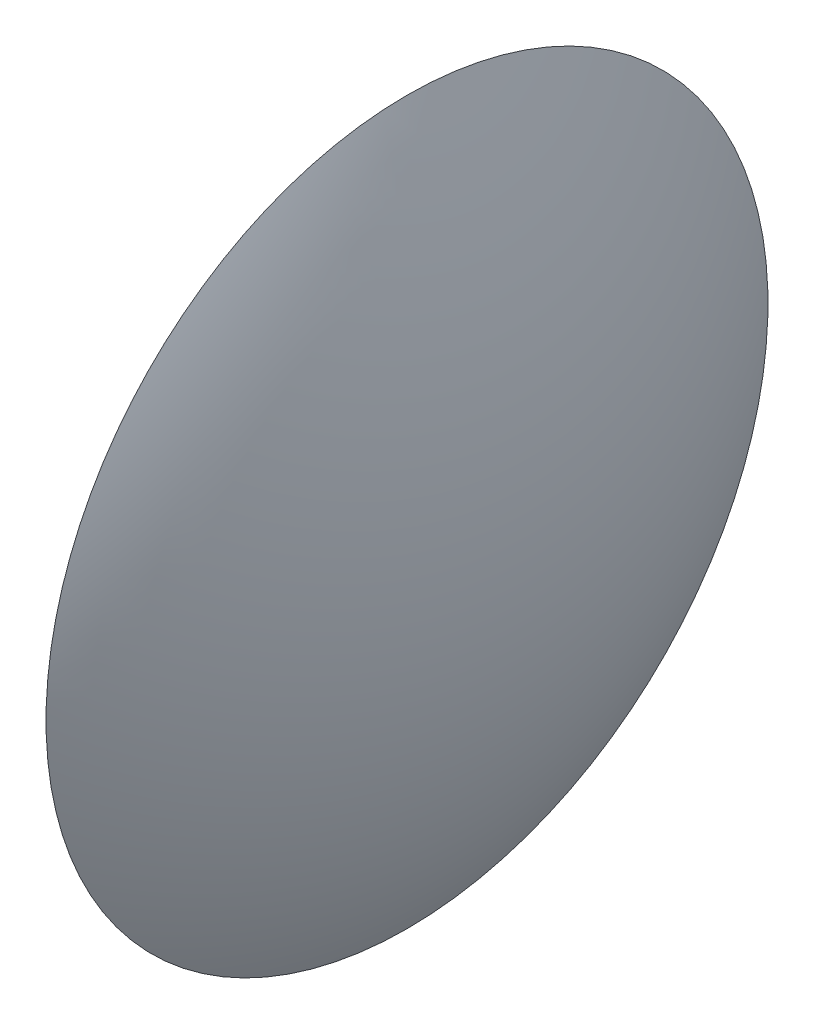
from build123d import *


with BuildPart() as part:
    # Sketch1 → Revolve1 (revolve)
    with BuildSketch(Plane.XY):
        with BuildLine():
            Line((0.5, 0), (-0.5, 0))
            Line((-0.5, 0), (-0.5, 3.9))
            ThreePointArc((-0.5, 3.9), (0.246020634, 2.013082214), (0.5, 0))
        make_face()
    revolve(axis=Axis((-2.450459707, 0, 0), (1, 0, 0)))


solid = part.part
